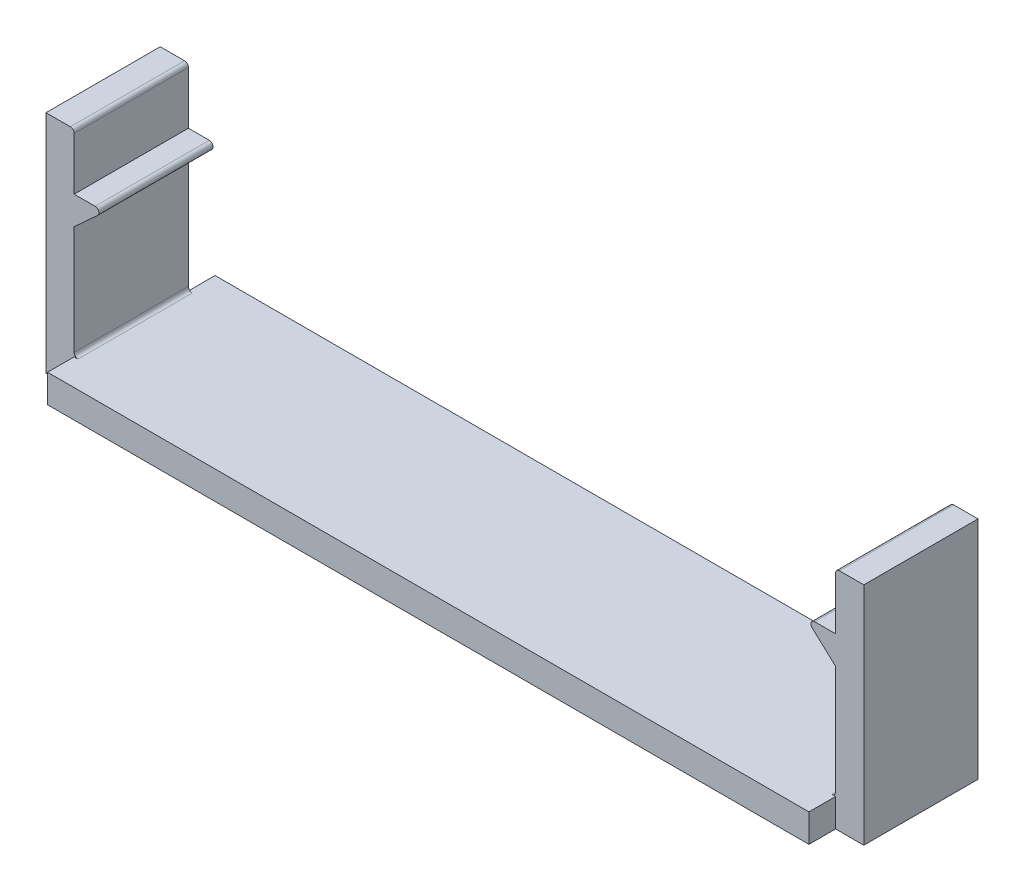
ISO-10303-21;
HEADER;
FILE_DESCRIPTION(('STEP AP214'),'2;1');
FILE_NAME('part.step','',(''),(''),'','','');
FILE_SCHEMA(('AUTOMOTIVE_DESIGN { 1 0 10303 214 1 1 1 1 }'));
ENDSEC;
DATA;
#1=APPLICATION_CONTEXT('core data for automotive mechanical design processes');
#2=APPLICATION_PROTOCOL_DEFINITION('international standard','automotive_design',2000,#1);
#3=PRODUCT_CONTEXT('',#1,'mechanical');
#4=PRODUCT('Part','Part','',(#3));
#5=PRODUCT_RELATED_PRODUCT_CATEGORY('part','',(#4));
#6=PRODUCT_DEFINITION_FORMATION('','',#4);
#7=PRODUCT_DEFINITION_CONTEXT('part definition',#1,'design');
#8=PRODUCT_DEFINITION('design','',#6,#7);
#9=PRODUCT_DEFINITION_SHAPE('','',#8);
#10=(LENGTH_UNIT() NAMED_UNIT(*) SI_UNIT(.MILLI.,.METRE.));
#11=(NAMED_UNIT(*) PLANE_ANGLE_UNIT() SI_UNIT($,.RADIAN.));
#12=(NAMED_UNIT(*) SI_UNIT($,.STERADIAN.) SOLID_ANGLE_UNIT());
#13=UNCERTAINTY_MEASURE_WITH_UNIT(LENGTH_MEASURE(1.E-05),#10,'distance_accuracy_value','');
#14=(GEOMETRIC_REPRESENTATION_CONTEXT(3) GLOBAL_UNCERTAINTY_ASSIGNED_CONTEXT((#13)) GLOBAL_UNIT_ASSIGNED_CONTEXT((#10,
#11,#12)) REPRESENTATION_CONTEXT('',''));
#15=CARTESIAN_POINT('',(0.,0.,0.));
#16=DIRECTION('',(0.,0.,1.));
#17=DIRECTION('',(1.,0.,0.));
#18=AXIS2_PLACEMENT_3D('',#15,#16,#17);
#19=CARTESIAN_POINT('',(12.7,-0.9398,2.794));
#20=DIRECTION('',(-1.,0.,0.));
#21=DIRECTION('',(0.,0.,1.));
#22=AXIS2_PLACEMENT_3D('',#19,#20,#21);
#23=PLANE('',#22);
#24=DIRECTION('',(0.,-1.,0.));
#25=VECTOR('',#24,1.);
#26=CARTESIAN_POINT('',(12.7,0.,-1.905));
#27=LINE('',#26,#25);
#28=CARTESIAN_POINT('',(12.7,0.,-1.905));
#29=VERTEX_POINT('',#28);
#30=CARTESIAN_POINT('',(12.7,-0.9398,-1.905));
#31=VERTEX_POINT('',#30);
#32=EDGE_CURVE('E469',#29,#31,#27,.T.);
#33=ORIENTED_EDGE('',*,*,#32,.T.);
#34=DIRECTION('',(0.,0.,-1.));
#35=VECTOR('',#34,1.);
#36=CARTESIAN_POINT('',(12.7,-0.9398,2.794));
#37=LINE('',#36,#35);
#38=CARTESIAN_POINT('',(12.7,-0.9398,-2.794));
#39=VERTEX_POINT('',#38);
#40=EDGE_CURVE('E244',#31,#39,#37,.T.);
#41=ORIENTED_EDGE('',*,*,#40,.T.);
#42=DIRECTION('',(0.,1.,0.));
#43=VECTOR('',#42,1.);
#44=CARTESIAN_POINT('',(12.7,-0.9398,-2.794));
#45=LINE('',#44,#43);
#46=CARTESIAN_POINT('',(12.7,0.,-2.794));
#47=VERTEX_POINT('',#46);
#48=EDGE_CURVE('E427',#39,#47,#45,.T.);
#49=ORIENTED_EDGE('',*,*,#48,.T.);
#50=DIRECTION('',(0.,0.,-1.));
#51=VECTOR('',#50,1.);
#52=CARTESIAN_POINT('',(12.7,0.,2.794));
#53=LINE('',#52,#51);
#54=EDGE_CURVE('E258',#29,#47,#53,.T.);
#55=ORIENTED_EDGE('',*,*,#54,.F.);
#56=EDGE_LOOP('',(#33,#41,#49,#55));
#57=FACE_BOUND('',#56,.T.);
#58=ADVANCED_FACE('F34',(#57),#23,.F.);
#59=CARTESIAN_POINT('',(-12.7,0.,1.905));
#60=DIRECTION('',(-1.,0.,0.));
#61=DIRECTION('',(0.,0.,1.));
#62=AXIS2_PLACEMENT_3D('',#59,#60,#61);
#63=PLANE('',#62);
#64=DIRECTION('',(0.,1.,0.));
#65=VECTOR('',#64,1.);
#66=CARTESIAN_POINT('',(-12.7,0.,1.905));
#67=LINE('',#66,#65);
#68=CARTESIAN_POINT('',(-12.7,0.126999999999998,1.905));
#69=VERTEX_POINT('',#68);
#70=CARTESIAN_POINT('',(-12.7,3.7592,1.905));
#71=VERTEX_POINT('',#70);
#72=EDGE_CURVE('E266',#69,#71,#67,.T.);
#73=ORIENTED_EDGE('',*,*,#72,.F.);
#74=DIRECTION('',(0.,0.,-1.));
#75=VECTOR('',#74,1.);
#76=CARTESIAN_POINT('',(-12.7,0.126999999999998,-1.905));
#77=LINE('',#76,#75);
#78=CARTESIAN_POINT('',(-12.7,0.126999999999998,-1.905));
#79=VERTEX_POINT('',#78);
#80=EDGE_CURVE('E359',#69,#79,#77,.T.);
#81=ORIENTED_EDGE('',*,*,#80,.T.);
#82=DIRECTION('',(0.,1.,0.));
#83=VECTOR('',#82,1.);
#84=CARTESIAN_POINT('',(-12.7,0.,-1.905));
#85=LINE('',#84,#83);
#86=CARTESIAN_POINT('',(-12.7,3.7592,-1.905));
#87=VERTEX_POINT('',#86);
#88=EDGE_CURVE('E261',#79,#87,#85,.T.);
#89=ORIENTED_EDGE('',*,*,#88,.T.);
#90=DIRECTION('',(0.,0.,-1.));
#91=VECTOR('',#90,1.);
#92=CARTESIAN_POINT('',(-12.7,3.7592,1.905));
#93=LINE('',#92,#91);
#94=EDGE_CURVE('E306',#71,#87,#93,.T.);
#95=ORIENTED_EDGE('',*,*,#94,.F.);
#96=EDGE_LOOP('',(#73,#81,#89,#95));
#97=FACE_BOUND('',#96,.T.);
#98=ADVANCED_FACE('F381',(#97),#63,.F.);
#99=CARTESIAN_POINT('',(-12.7,3.7592,1.905));
#100=DIRECTION('',(-0.676508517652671,0.736434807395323,0.));
#101=DIRECTION('',(-0.736434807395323,-0.676508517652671,0.));
#102=AXIS2_PLACEMENT_3D('',#99,#100,#101);
#103=PLANE('',#102);
#104=DIRECTION('',(0.736434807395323,0.676508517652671,0.));
#105=VECTOR('',#104,1.);
#106=CARTESIAN_POINT('',(-12.7,3.7592,-1.905));
#107=LINE('',#106,#105);
#108=CARTESIAN_POINT('',(-11.9170127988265,4.47847277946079,-1.905));
#109=VERTEX_POINT('',#108);
#110=EDGE_CURVE('E284',#87,#109,#107,.T.);
#111=ORIENTED_EDGE('',*,*,#110,.T.);
#112=DIRECTION('',(0.,0.,-1.));
#113=VECTOR('',#112,1.);
#114=CARTESIAN_POINT('',(-11.9170127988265,4.47847277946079,1.905));
#115=LINE('',#114,#113);
#116=CARTESIAN_POINT('',(-11.9170127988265,4.47847277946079,1.905));
#117=VERTEX_POINT('',#116);
#118=EDGE_CURVE('E343',#109,#117,#115,.F.);
#119=ORIENTED_EDGE('',*,*,#118,.T.);
#120=DIRECTION('',(0.736434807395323,0.676508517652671,0.));
#121=VECTOR('',#120,1.);
#122=CARTESIAN_POINT('',(-12.7,3.7592,1.905));
#123=LINE('',#122,#121);
#124=EDGE_CURVE('E265',#71,#117,#123,.T.);
#125=ORIENTED_EDGE('',*,*,#124,.F.);
#126=ORIENTED_EDGE('',*,*,#94,.T.);
#127=EDGE_LOOP('',(#111,#119,#125,#126));
#128=FACE_BOUND('',#127,.T.);
#129=ADVANCED_FACE('F384',(#128),#103,.F.);
#130=CARTESIAN_POINT('',(-12.7,4.699,1.905));
#131=DIRECTION('',(0.,-1.,0.));
#132=DIRECTION('',(0.,0.,-1.));
#133=AXIS2_PLACEMENT_3D('',#130,#131,#132);
#134=PLANE('',#133);
#135=DIRECTION('',(-1.,0.,0.));
#136=VECTOR('',#135,1.);
#137=CARTESIAN_POINT('',(-12.7,4.699,1.905));
#138=LINE('',#137,#136);
#139=CARTESIAN_POINT('',(-12.0029293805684,4.699,1.905));
#140=VERTEX_POINT('',#139);
#141=CARTESIAN_POINT('',(-12.7,4.699,1.905));
#142=VERTEX_POINT('',#141);
#143=EDGE_CURVE('E269',#140,#142,#138,.T.);
#144=ORIENTED_EDGE('',*,*,#143,.F.);
#145=DIRECTION('',(0.,0.,-1.));
#146=VECTOR('',#145,1.);
#147=CARTESIAN_POINT('',(-12.0029293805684,4.699,1.905));
#148=LINE('',#147,#146);
#149=CARTESIAN_POINT('',(-12.0029293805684,4.699,-1.905));
#150=VERTEX_POINT('',#149);
#151=EDGE_CURVE('E340',#140,#150,#148,.T.);
#152=ORIENTED_EDGE('',*,*,#151,.T.);
#153=DIRECTION('',(-1.,0.,0.));
#154=VECTOR('',#153,1.);
#155=CARTESIAN_POINT('',(-12.7,4.699,-1.905));
#156=LINE('',#155,#154);
#157=CARTESIAN_POINT('',(-12.7,4.699,-1.905));
#158=VERTEX_POINT('',#157);
#159=EDGE_CURVE('E287',#150,#158,#156,.T.);
#160=ORIENTED_EDGE('',*,*,#159,.T.);
#161=DIRECTION('',(0.,0.,-1.));
#162=VECTOR('',#161,1.);
#163=CARTESIAN_POINT('',(-12.7,4.699,1.905));
#164=LINE('',#163,#162);
#165=EDGE_CURVE('E303',#142,#158,#164,.T.);
#166=ORIENTED_EDGE('',*,*,#165,.F.);
#167=EDGE_LOOP('',(#144,#152,#160,#166));
#168=FACE_BOUND('',#167,.T.);
#169=ADVANCED_FACE('F393',(#168),#134,.F.);
#170=CARTESIAN_POINT('',(-12.7,4.699,1.905));
#171=DIRECTION('',(-1.,0.,0.));
#172=DIRECTION('',(0.,0.,1.));
#173=AXIS2_PLACEMENT_3D('',#170,#171,#172);
#174=PLANE('',#173);
#175=DIRECTION('',(0.,1.,0.));
#176=VECTOR('',#175,1.);
#177=CARTESIAN_POINT('',(-12.7,4.699,-1.905));
#178=LINE('',#177,#176);
#179=CARTESIAN_POINT('',(-12.7,6.45668,-1.905));
#180=VERTEX_POINT('',#179);
#181=EDGE_CURVE('E289',#158,#180,#178,.T.);
#182=ORIENTED_EDGE('',*,*,#181,.T.);
#183=DIRECTION('',(0.,0.,-1.));
#184=VECTOR('',#183,1.);
#185=CARTESIAN_POINT('',(-12.7,6.45668,1.905));
#186=LINE('',#185,#184);
#187=CARTESIAN_POINT('',(-12.7,6.45668,1.905));
#188=VERTEX_POINT('',#187);
#189=EDGE_CURVE('E329',#180,#188,#186,.F.);
#190=ORIENTED_EDGE('',*,*,#189,.T.);
#191=DIRECTION('',(0.,1.,0.));
#192=VECTOR('',#191,1.);
#193=CARTESIAN_POINT('',(-12.7,4.699,1.905));
#194=LINE('',#193,#192);
#195=EDGE_CURVE('E271',#142,#188,#194,.T.);
#196=ORIENTED_EDGE('',*,*,#195,.F.);
#197=ORIENTED_EDGE('',*,*,#165,.T.);
#198=EDGE_LOOP('',(#182,#190,#196,#197));
#199=FACE_BOUND('',#198,.T.);
#200=ADVANCED_FACE('F398',(#199),#174,.F.);
#201=CARTESIAN_POINT('',(-12.7,6.58368,1.905));
#202=DIRECTION('',(0.,-1.,0.));
#203=DIRECTION('',(0.,0.,-1.));
#204=AXIS2_PLACEMENT_3D('',#201,#202,#203);
#205=PLANE('',#204);
#206=DIRECTION('',(-1.,0.,0.));
#207=VECTOR('',#206,1.);
#208=CARTESIAN_POINT('',(-12.7,6.58368,1.905));
#209=LINE('',#208,#207);
#210=CARTESIAN_POINT('',(-12.827,6.58368,1.905));
#211=VERTEX_POINT('',#210);
#212=CARTESIAN_POINT('',(-13.6398,6.58368,1.905));
#213=VERTEX_POINT('',#212);
#214=EDGE_CURVE('E274',#211,#213,#209,.T.);
#215=ORIENTED_EDGE('',*,*,#214,.F.);
#216=DIRECTION('',(0.,0.,-1.));
#217=VECTOR('',#216,1.);
#218=CARTESIAN_POINT('',(-12.827,6.58368,1.905));
#219=LINE('',#218,#217);
#220=CARTESIAN_POINT('',(-12.827,6.58368,-1.905));
#221=VERTEX_POINT('',#220);
#222=EDGE_CURVE('E322',#211,#221,#219,.T.);
#223=ORIENTED_EDGE('',*,*,#222,.T.);
#224=DIRECTION('',(-1.,0.,0.));
#225=VECTOR('',#224,1.);
#226=CARTESIAN_POINT('',(-12.7,6.58368,-1.905));
#227=LINE('',#226,#225);
#228=CARTESIAN_POINT('',(-13.6398,6.58368,-1.905));
#229=VERTEX_POINT('',#228);
#230=EDGE_CURVE('E292',#221,#229,#227,.T.);
#231=ORIENTED_EDGE('',*,*,#230,.T.);
#232=DIRECTION('',(0.,0.,-1.));
#233=VECTOR('',#232,1.);
#234=CARTESIAN_POINT('',(-13.6398,6.58368,1.905));
#235=LINE('',#234,#233);
#236=EDGE_CURVE('E300',#213,#229,#235,.T.);
#237=ORIENTED_EDGE('',*,*,#236,.F.);
#238=EDGE_LOOP('',(#215,#223,#231,#237));
#239=FACE_BOUND('',#238,.T.);
#240=ADVANCED_FACE('F407',(#239),#205,.F.);
#241=CARTESIAN_POINT('',(-13.6398,6.58368,1.905));
#242=DIRECTION('',(1.,0.,0.));
#243=DIRECTION('',(0.,0.,-1.));
#244=AXIS2_PLACEMENT_3D('',#241,#242,#243);
#245=PLANE('',#244);
#246=DIRECTION('',(0.,-1.,0.));
#247=VECTOR('',#246,1.);
#248=CARTESIAN_POINT('',(-13.6398,6.58368,-1.905));
#249=LINE('',#248,#247);
#250=CARTESIAN_POINT('',(-13.6398,-0.9398,-1.905));
#251=VERTEX_POINT('',#250);
#252=EDGE_CURVE('E294',#229,#251,#249,.T.);
#253=ORIENTED_EDGE('',*,*,#252,.T.);
#254=DIRECTION('',(0.,0.,-1.));
#255=VECTOR('',#254,1.);
#256=CARTESIAN_POINT('',(-13.6398,-0.9398,1.905));
#257=LINE('',#256,#255);
#258=CARTESIAN_POINT('',(-13.6398,-0.9398,1.905));
#259=VERTEX_POINT('',#258);
#260=EDGE_CURVE('E280',#259,#251,#257,.T.);
#261=ORIENTED_EDGE('',*,*,#260,.F.);
#262=DIRECTION('',(0.,-1.,0.));
#263=VECTOR('',#262,1.);
#264=CARTESIAN_POINT('',(-13.6398,6.58368,1.905));
#265=LINE('',#264,#263);
#266=EDGE_CURVE('E276',#213,#259,#265,.T.);
#267=ORIENTED_EDGE('',*,*,#266,.F.);
#268=ORIENTED_EDGE('',*,*,#236,.T.);
#269=EDGE_LOOP('',(#253,#261,#267,#268));
#270=FACE_BOUND('',#269,.T.);
#271=ADVANCED_FACE('F412',(#270),#245,.F.);
#272=CARTESIAN_POINT('',(-13.6398,-0.9398,1.905));
#273=DIRECTION('',(0.,1.,0.));
#274=DIRECTION('',(-1.,0.,0.));
#275=AXIS2_PLACEMENT_3D('',#272,#273,#274);
#276=PLANE('',#275);
#277=DIRECTION('',(1.,0.,0.));
#278=VECTOR('',#277,1.);
#279=CARTESIAN_POINT('',(-13.6398,-0.9398,-1.905));
#280=LINE('',#279,#278);
#281=CARTESIAN_POINT('',(-12.7,-0.9398,-1.905));
#282=VERTEX_POINT('',#281);
#283=EDGE_CURVE('E296',#251,#282,#280,.T.);
#284=ORIENTED_EDGE('',*,*,#283,.T.);
#285=DIRECTION('',(0.,0.,-1.));
#286=VECTOR('',#285,1.);
#287=CARTESIAN_POINT('',(-12.7,-0.9398,2.794));
#288=LINE('',#287,#286);
#289=CARTESIAN_POINT('',(-12.7,-0.9398,-2.794));
#290=VERTEX_POINT('',#289);
#291=EDGE_CURVE('E243',#282,#290,#288,.T.);
#292=ORIENTED_EDGE('',*,*,#291,.T.);
#293=DIRECTION('',(1.,0.,0.));
#294=VECTOR('',#293,1.);
#295=CARTESIAN_POINT('',(-12.7,-0.9398,-2.794));
#296=LINE('',#295,#294);
#297=EDGE_CURVE('E250',#290,#39,#296,.T.);
#298=ORIENTED_EDGE('',*,*,#297,.T.);
#299=ORIENTED_EDGE('',*,*,#40,.F.);
#300=DIRECTION('',(1.,0.,0.));
#301=VECTOR('',#300,1.);
#302=CARTESIAN_POINT('',(13.6398,-0.9398,-1.905));
#303=LINE('',#302,#301);
#304=CARTESIAN_POINT('',(13.6398,-0.9398,-1.905));
#305=VERTEX_POINT('',#304);
#306=EDGE_CURVE('E464',#31,#305,#303,.T.);
#307=ORIENTED_EDGE('',*,*,#306,.T.);
#308=DIRECTION('',(0.,0.,-1.));
#309=VECTOR('',#308,1.);
#310=CARTESIAN_POINT('',(13.6398,-0.9398,1.905));
#311=LINE('',#310,#309);
#312=CARTESIAN_POINT('',(13.6398,-0.9398,1.905));
#313=VERTEX_POINT('',#312);
#314=EDGE_CURVE('E236',#313,#305,#311,.T.);
#315=ORIENTED_EDGE('',*,*,#314,.F.);
#316=DIRECTION('',(1.,0.,0.));
#317=VECTOR('',#316,1.);
#318=CARTESIAN_POINT('',(13.6398,-0.9398,1.905));
#319=LINE('',#318,#317);
#320=CARTESIAN_POINT('',(12.7,-0.9398,1.905));
#321=VERTEX_POINT('',#320);
#322=EDGE_CURVE('E220',#321,#313,#319,.T.);
#323=ORIENTED_EDGE('',*,*,#322,.F.);
#324=CARTESIAN_POINT('',(12.7,-0.9398,2.794));
#325=VERTEX_POINT('',#324);
#326=EDGE_CURVE('E233',#325,#321,#37,.T.);
#327=ORIENTED_EDGE('',*,*,#326,.F.);
#328=DIRECTION('',(1.,0.,0.));
#329=VECTOR('',#328,1.);
#330=CARTESIAN_POINT('',(-12.7,-0.9398,2.794));
#331=LINE('',#330,#329);
#332=CARTESIAN_POINT('',(-12.7,-0.9398,2.794));
#333=VERTEX_POINT('',#332);
#334=EDGE_CURVE('E248',#333,#325,#331,.T.);
#335=ORIENTED_EDGE('',*,*,#334,.F.);
#336=CARTESIAN_POINT('',(-12.7,-0.9398,1.905));
#337=VERTEX_POINT('',#336);
#338=EDGE_CURVE('E246',#333,#337,#288,.T.);
#339=ORIENTED_EDGE('',*,*,#338,.T.);
#340=DIRECTION('',(1.,0.,0.));
#341=VECTOR('',#340,1.);
#342=CARTESIAN_POINT('',(-13.6398,-0.9398,1.905));
#343=LINE('',#342,#341);
#344=EDGE_CURVE('E278',#259,#337,#343,.T.);
#345=ORIENTED_EDGE('',*,*,#344,.F.);
#346=ORIENTED_EDGE('',*,*,#260,.T.);
#347=EDGE_LOOP('',(#284,#292,#298,#299,#307,#315,#323,#327,#335,#339,#345,#346));
#348=FACE_BOUND('',#347,.T.);
#349=ADVANCED_FACE('F231',(#348),#276,.F.);
#350=CARTESIAN_POINT('',(-12.7,6.58368,1.905));
#351=DIRECTION('',(0.,0.,-1.));
#352=DIRECTION('',(-1.,0.,0.));
#353=AXIS2_PLACEMENT_3D('',#350,#351,#352);
#354=PLANE('',#353);
#355=ORIENTED_EDGE('',*,*,#195,.T.);
#356=CARTESIAN_POINT('',(-12.827,6.45668,1.905));
#357=DIRECTION('',(0.,0.,-1.));
#358=DIRECTION('',(-1.,0.,0.));
#359=AXIS2_PLACEMENT_3D('',#356,#357,#358);
#360=CIRCLE('',#359,0.127);
#361=EDGE_CURVE('E333',#188,#211,#360,.F.);
#362=ORIENTED_EDGE('',*,*,#361,.T.);
#363=ORIENTED_EDGE('',*,*,#214,.T.);
#364=ORIENTED_EDGE('',*,*,#266,.T.);
#365=ORIENTED_EDGE('',*,*,#344,.T.);
#366=CARTESIAN_POINT('',(-12.7,0.,1.905));
#367=VERTEX_POINT('',#366);
#368=EDGE_CURVE('E262',#337,#367,#67,.T.);
#369=ORIENTED_EDGE('',*,*,#368,.T.);
#370=DIRECTION('',(-1.,0.,0.));
#371=VECTOR('',#370,1.);
#372=CARTESIAN_POINT('',(-12.7,0.,1.905));
#373=LINE('',#372,#371);
#374=CARTESIAN_POINT('',(-12.573,0.,1.905));
#375=VERTEX_POINT('',#374);
#376=EDGE_CURVE('E345',#375,#367,#373,.T.);
#377=ORIENTED_EDGE('',*,*,#376,.F.);
#378=CARTESIAN_POINT('',(-12.573,0.126999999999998,1.905));
#379=DIRECTION('',(0.,0.,-1.));
#380=DIRECTION('',(-1.,0.,0.));
#381=AXIS2_PLACEMENT_3D('',#378,#379,#380);
#382=CIRCLE('',#381,0.127);
#383=EDGE_CURVE('E11',#375,#69,#382,.T.);
#384=ORIENTED_EDGE('',*,*,#383,.T.);
#385=ORIENTED_EDGE('',*,*,#72,.T.);
#386=ORIENTED_EDGE('',*,*,#124,.T.);
#387=CARTESIAN_POINT('',(-12.0029293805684,4.572,1.905));
#388=DIRECTION('',(0.,0.,-1.));
#389=DIRECTION('',(-1.,0.,0.));
#390=AXIS2_PLACEMENT_3D('',#387,#388,#389);
#391=CIRCLE('',#390,0.127);
#392=EDGE_CURVE('E331',#117,#140,#391,.F.);
#393=ORIENTED_EDGE('',*,*,#392,.T.);
#394=ORIENTED_EDGE('',*,*,#143,.T.);
#395=EDGE_LOOP('',(#355,#362,#363,#364,#365,#369,#377,#384,#385,#386,#393,#394));
#396=FACE_BOUND('',#395,.T.);
#397=ADVANCED_FACE('F378',(#396),#354,.F.);
#398=CARTESIAN_POINT('',(-12.7,6.58368,-1.905));
#399=DIRECTION('',(0.,0.,-1.));
#400=DIRECTION('',(-1.,0.,0.));
#401=AXIS2_PLACEMENT_3D('',#398,#399,#400);
#402=PLANE('',#401);
#403=ORIENTED_EDGE('',*,*,#230,.F.);
#404=CARTESIAN_POINT('',(-12.827,6.45668,-1.905));
#405=DIRECTION('',(0.,0.,-1.));
#406=DIRECTION('',(-1.,0.,0.));
#407=AXIS2_PLACEMENT_3D('',#404,#405,#406);
#408=CIRCLE('',#407,0.127);
#409=EDGE_CURVE('E327',#221,#180,#408,.T.);
#410=ORIENTED_EDGE('',*,*,#409,.T.);
#411=ORIENTED_EDGE('',*,*,#181,.F.);
#412=ORIENTED_EDGE('',*,*,#159,.F.);
#413=CARTESIAN_POINT('',(-12.0029293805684,4.572,-1.905));
#414=DIRECTION('',(0.,0.,-1.));
#415=DIRECTION('',(-1.,0.,0.));
#416=AXIS2_PLACEMENT_3D('',#413,#414,#415);
#417=CIRCLE('',#416,0.127);
#418=EDGE_CURVE('E325',#150,#109,#417,.T.);
#419=ORIENTED_EDGE('',*,*,#418,.T.);
#420=ORIENTED_EDGE('',*,*,#110,.F.);
#421=ORIENTED_EDGE('',*,*,#88,.F.);
#422=CARTESIAN_POINT('',(-12.573,0.126999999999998,-1.905));
#423=DIRECTION('',(0.,0.,-1.));
#424=DIRECTION('',(-1.,0.,0.));
#425=AXIS2_PLACEMENT_3D('',#422,#423,#424);
#426=CIRCLE('',#425,0.127);
#427=CARTESIAN_POINT('',(-12.573,0.,-1.905));
#428=VERTEX_POINT('',#427);
#429=EDGE_CURVE('E42',#79,#428,#426,.F.);
#430=ORIENTED_EDGE('',*,*,#429,.T.);
#431=DIRECTION('',(1.,0.,0.));
#432=VECTOR('',#431,1.);
#433=CARTESIAN_POINT('',(12.7,0.,-1.905));
#434=LINE('',#433,#432);
#435=CARTESIAN_POINT('',(-12.7,0.,-1.905));
#436=VERTEX_POINT('',#435);
#437=EDGE_CURVE('E49',#436,#428,#434,.T.);
#438=ORIENTED_EDGE('',*,*,#437,.F.);
#439=EDGE_CURVE('E281',#282,#436,#85,.T.);
#440=ORIENTED_EDGE('',*,*,#439,.F.);
#441=ORIENTED_EDGE('',*,*,#283,.F.);
#442=ORIENTED_EDGE('',*,*,#252,.F.);
#443=EDGE_LOOP('',(#403,#410,#411,#412,#419,#420,#421,#430,#438,#440,#441,#442));
#444=FACE_BOUND('',#443,.T.);
#445=ADVANCED_FACE('F367',(#444),#402,.T.);
#446=CARTESIAN_POINT('',(-12.7,0.,2.794));
#447=DIRECTION('',(1.,0.,0.));
#448=DIRECTION('',(0.,0.,-1.));
#449=AXIS2_PLACEMENT_3D('',#446,#447,#448);
#450=PLANE('',#449);
#451=DIRECTION('',(0.,0.,-1.));
#452=VECTOR('',#451,1.);
#453=CARTESIAN_POINT('',(-12.7,0.,2.794));
#454=LINE('',#453,#452);
#455=CARTESIAN_POINT('',(-12.7,0.,2.794));
#456=VERTEX_POINT('',#455);
#457=EDGE_CURVE('E255',#456,#367,#454,.T.);
#458=ORIENTED_EDGE('',*,*,#457,.T.);
#459=ORIENTED_EDGE('',*,*,#368,.F.);
#460=ORIENTED_EDGE('',*,*,#338,.F.);
#461=DIRECTION('',(0.,-1.,0.));
#462=VECTOR('',#461,1.);
#463=CARTESIAN_POINT('',(-12.7,0.,2.794));
#464=LINE('',#463,#462);
#465=EDGE_CURVE('E421',#456,#333,#464,.T.);
#466=ORIENTED_EDGE('',*,*,#465,.F.);
#467=EDGE_LOOP('',(#458,#459,#460,#466));
#468=FACE_BOUND('',#467,.T.);
#469=ADVANCED_FACE('F417',(#468),#450,.F.);
#470=ORIENTED_EDGE('',*,*,#326,.T.);
#471=DIRECTION('',(0.,-1.,0.));
#472=VECTOR('',#471,1.);
#473=CARTESIAN_POINT('',(12.7,0.,1.905));
#474=LINE('',#473,#472);
#475=CARTESIAN_POINT('',(12.7,0.,1.905));
#476=VERTEX_POINT('',#475);
#477=EDGE_CURVE('E216',#476,#321,#474,.T.);
#478=ORIENTED_EDGE('',*,*,#477,.F.);
#479=CARTESIAN_POINT('',(12.7,0.,2.794));
#480=VERTEX_POINT('',#479);
#481=EDGE_CURVE('E259',#480,#476,#53,.T.);
#482=ORIENTED_EDGE('',*,*,#481,.F.);
#483=DIRECTION('',(0.,1.,0.));
#484=VECTOR('',#483,1.);
#485=CARTESIAN_POINT('',(12.7,-0.9398,2.794));
#486=LINE('',#485,#484);
#487=EDGE_CURVE('E242',#325,#480,#486,.T.);
#488=ORIENTED_EDGE('',*,*,#487,.F.);
#489=EDGE_LOOP('',(#470,#478,#482,#488));
#490=FACE_BOUND('',#489,.T.);
#491=ADVANCED_FACE('F240',(#490),#23,.F.);
#492=CARTESIAN_POINT('',(12.7,0.,2.794));
#493=DIRECTION('',(0.,-1.,0.));
#494=DIRECTION('',(1.,0.,0.));
#495=AXIS2_PLACEMENT_3D('',#492,#493,#494);
#496=PLANE('',#495);
#497=DIRECTION('',(0.,0.,-1.));
#498=VECTOR('',#497,1.);
#499=CARTESIAN_POINT('',(12.573,0.,-1.905));
#500=LINE('',#499,#498);
#501=CARTESIAN_POINT('',(12.573,0.,1.905));
#502=VERTEX_POINT('',#501);
#503=CARTESIAN_POINT('',(12.573,0.,-1.905));
#504=VERTEX_POINT('',#503);
#505=EDGE_CURVE('E352',#502,#504,#500,.T.);
#506=ORIENTED_EDGE('',*,*,#505,.T.);
#507=DIRECTION('',(1.,0.,0.));
#508=VECTOR('',#507,1.);
#509=CARTESIAN_POINT('',(12.7,0.,-1.905));
#510=LINE('',#509,#508);
#511=EDGE_CURVE('E355',#504,#29,#510,.T.);
#512=ORIENTED_EDGE('',*,*,#511,.T.);
#513=ORIENTED_EDGE('',*,*,#54,.T.);
#514=DIRECTION('',(-1.,0.,0.));
#515=VECTOR('',#514,1.);
#516=CARTESIAN_POINT('',(12.7,0.,-2.794));
#517=LINE('',#516,#515);
#518=CARTESIAN_POINT('',(-12.7,0.,-2.794));
#519=VERTEX_POINT('',#518);
#520=EDGE_CURVE('E430',#47,#519,#517,.T.);
#521=ORIENTED_EDGE('',*,*,#520,.T.);
#522=EDGE_CURVE('E254',#436,#519,#454,.T.);
#523=ORIENTED_EDGE('',*,*,#522,.F.);
#524=ORIENTED_EDGE('',*,*,#437,.T.);
#525=DIRECTION('',(0.,0.,-1.));
#526=VECTOR('',#525,1.);
#527=CARTESIAN_POINT('',(-12.573,0.,1.905));
#528=LINE('',#527,#526);
#529=EDGE_CURVE('E347',#428,#375,#528,.F.);
#530=ORIENTED_EDGE('',*,*,#529,.T.);
#531=ORIENTED_EDGE('',*,*,#376,.T.);
#532=ORIENTED_EDGE('',*,*,#457,.F.);
#533=DIRECTION('',(-1.,0.,0.));
#534=VECTOR('',#533,1.);
#535=CARTESIAN_POINT('',(12.7,0.,2.794));
#536=LINE('',#535,#534);
#537=EDGE_CURVE('E423',#480,#456,#536,.T.);
#538=ORIENTED_EDGE('',*,*,#537,.F.);
#539=ORIENTED_EDGE('',*,*,#481,.T.);
#540=DIRECTION('',(-1.,0.,0.));
#541=VECTOR('',#540,1.);
#542=CARTESIAN_POINT('',(12.7,0.,1.905));
#543=LINE('',#542,#541);
#544=EDGE_CURVE('E57',#476,#502,#543,.T.);
#545=ORIENTED_EDGE('',*,*,#544,.T.);
#546=EDGE_LOOP('',(#506,#512,#513,#521,#523,#524,#530,#531,#532,#538,#539,#545));
#547=FACE_BOUND('',#546,.T.);
#548=ADVANCED_FACE('F373',(#547),#496,.F.);
#549=ORIENTED_EDGE('',*,*,#439,.T.);
#550=ORIENTED_EDGE('',*,*,#522,.T.);
#551=DIRECTION('',(0.,-1.,0.));
#552=VECTOR('',#551,1.);
#553=CARTESIAN_POINT('',(-12.7,0.,-2.794));
#554=LINE('',#553,#552);
#555=EDGE_CURVE('E431',#519,#290,#554,.T.);
#556=ORIENTED_EDGE('',*,*,#555,.T.);
#557=ORIENTED_EDGE('',*,*,#291,.F.);
#558=EDGE_LOOP('',(#549,#550,#556,#557));
#559=FACE_BOUND('',#558,.T.);
#560=ADVANCED_FACE('F493',(#559),#450,.F.);
#561=CARTESIAN_POINT('',(12.7,-0.9398,2.794));
#562=DIRECTION('',(0.,0.,-1.));
#563=DIRECTION('',(-1.,0.,0.));
#564=AXIS2_PLACEMENT_3D('',#561,#562,#563);
#565=PLANE('',#564);
#566=ORIENTED_EDGE('',*,*,#487,.T.);
#567=ORIENTED_EDGE('',*,*,#537,.T.);
#568=ORIENTED_EDGE('',*,*,#465,.T.);
#569=ORIENTED_EDGE('',*,*,#334,.T.);
#570=EDGE_LOOP('',(#566,#567,#568,#569));
#571=FACE_BOUND('',#570,.T.);
#572=ADVANCED_FACE('F490',(#571),#565,.F.);
#573=CARTESIAN_POINT('',(12.7,-0.9398,-2.794));
#574=DIRECTION('',(0.,0.,-1.));
#575=DIRECTION('',(-1.,0.,0.));
#576=AXIS2_PLACEMENT_3D('',#573,#574,#575);
#577=PLANE('',#576);
#578=ORIENTED_EDGE('',*,*,#48,.F.);
#579=ORIENTED_EDGE('',*,*,#297,.F.);
#580=ORIENTED_EDGE('',*,*,#555,.F.);
#581=ORIENTED_EDGE('',*,*,#520,.F.);
#582=EDGE_LOOP('',(#578,#579,#580,#581));
#583=FACE_BOUND('',#582,.T.);
#584=ADVANCED_FACE('F492',(#583),#577,.T.);
#585=CARTESIAN_POINT('',(12.7,0.,1.905));
#586=DIRECTION('',(1.,0.,0.));
#587=DIRECTION('',(0.,0.,-1.));
#588=AXIS2_PLACEMENT_3D('',#585,#586,#587);
#589=PLANE('',#588);
#590=CARTESIAN_POINT('',(12.7,3.7592,-1.905));
#591=VERTEX_POINT('',#590);
#592=CARTESIAN_POINT('',(12.7,0.127000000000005,-1.905));
#593=VERTEX_POINT('',#592);
#594=EDGE_CURVE('E466',#591,#593,#27,.T.);
#595=ORIENTED_EDGE('',*,*,#594,.T.);
#596=DIRECTION('',(0.,0.,-1.));
#597=VECTOR('',#596,1.);
#598=CARTESIAN_POINT('',(12.7,0.127000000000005,1.905));
#599=LINE('',#598,#597);
#600=CARTESIAN_POINT('',(12.7,0.127000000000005,1.905));
#601=VERTEX_POINT('',#600);
#602=EDGE_CURVE('E357',#593,#601,#599,.F.);
#603=ORIENTED_EDGE('',*,*,#602,.T.);
#604=CARTESIAN_POINT('',(12.7,3.7592,1.905));
#605=VERTEX_POINT('',#604);
#606=EDGE_CURVE('E225',#605,#601,#474,.T.);
#607=ORIENTED_EDGE('',*,*,#606,.F.);
#608=DIRECTION('',(0.,0.,-1.));
#609=VECTOR('',#608,1.);
#610=CARTESIAN_POINT('',(12.7,3.7592,1.905));
#611=LINE('',#610,#609);
#612=EDGE_CURVE('E449',#605,#591,#611,.T.);
#613=ORIENTED_EDGE('',*,*,#612,.T.);
#614=EDGE_LOOP('',(#595,#603,#607,#613));
#615=FACE_BOUND('',#614,.T.);
#616=ADVANCED_FACE('F499',(#615),#589,.F.);
#617=CARTESIAN_POINT('',(13.6398,6.58368,1.905));
#618=DIRECTION('',(-1.,0.,0.));
#619=DIRECTION('',(0.,0.,1.));
#620=AXIS2_PLACEMENT_3D('',#617,#618,#619);
#621=PLANE('',#620);
#622=DIRECTION('',(0.,1.,0.));
#623=VECTOR('',#622,1.);
#624=CARTESIAN_POINT('',(13.6398,6.58368,-1.905));
#625=LINE('',#624,#623);
#626=CARTESIAN_POINT('',(13.6398,6.58368,-1.905));
#627=VERTEX_POINT('',#626);
#628=EDGE_CURVE('E462',#305,#627,#625,.T.);
#629=ORIENTED_EDGE('',*,*,#628,.T.);
#630=DIRECTION('',(0.,0.,-1.));
#631=VECTOR('',#630,1.);
#632=CARTESIAN_POINT('',(13.6398,6.58368,1.905));
#633=LINE('',#632,#631);
#634=CARTESIAN_POINT('',(13.6398,6.58368,1.905));
#635=VERTEX_POINT('',#634);
#636=EDGE_CURVE('E443',#635,#627,#633,.T.);
#637=ORIENTED_EDGE('',*,*,#636,.F.);
#638=DIRECTION('',(0.,1.,0.));
#639=VECTOR('',#638,1.);
#640=CARTESIAN_POINT('',(13.6398,6.58368,1.905));
#641=LINE('',#640,#639);
#642=EDGE_CURVE('E238',#313,#635,#641,.T.);
#643=ORIENTED_EDGE('',*,*,#642,.F.);
#644=ORIENTED_EDGE('',*,*,#314,.T.);
#645=EDGE_LOOP('',(#629,#637,#643,#644));
#646=FACE_BOUND('',#645,.T.);
#647=ADVANCED_FACE('F644',(#646),#621,.F.);
#648=CARTESIAN_POINT('',(12.7,6.58368,1.905));
#649=DIRECTION('',(0.,-1.,0.));
#650=DIRECTION('',(0.,0.,-1.));
#651=AXIS2_PLACEMENT_3D('',#648,#649,#650);
#652=PLANE('',#651);
#653=DIRECTION('',(-1.,0.,0.));
#654=VECTOR('',#653,1.);
#655=CARTESIAN_POINT('',(12.7,6.58368,-1.905));
#656=LINE('',#655,#654);
#657=CARTESIAN_POINT('',(12.827,6.58368,-1.905));
#658=VERTEX_POINT('',#657);
#659=EDGE_CURVE('E459',#627,#658,#656,.T.);
#660=ORIENTED_EDGE('',*,*,#659,.T.);
#661=DIRECTION('',(0.,0.,-1.));
#662=VECTOR('',#661,1.);
#663=CARTESIAN_POINT('',(12.827,6.58368,1.905));
#664=LINE('',#663,#662);
#665=CARTESIAN_POINT('',(12.827,6.58368,1.905));
#666=VERTEX_POINT('',#665);
#667=EDGE_CURVE('E316',#658,#666,#664,.F.);
#668=ORIENTED_EDGE('',*,*,#667,.T.);
#669=DIRECTION('',(-1.,0.,0.));
#670=VECTOR('',#669,1.);
#671=CARTESIAN_POINT('',(12.7,6.58368,1.905));
#672=LINE('',#671,#670);
#673=EDGE_CURVE('E476',#635,#666,#672,.T.);
#674=ORIENTED_EDGE('',*,*,#673,.F.);
#675=ORIENTED_EDGE('',*,*,#636,.T.);
#676=EDGE_LOOP('',(#660,#668,#674,#675));
#677=FACE_BOUND('',#676,.T.);
#678=ADVANCED_FACE('F634',(#677),#652,.F.);
#679=CARTESIAN_POINT('',(12.7,4.699,1.905));
#680=DIRECTION('',(1.,0.,0.));
#681=DIRECTION('',(0.,0.,-1.));
#682=AXIS2_PLACEMENT_3D('',#679,#680,#681);
#683=PLANE('',#682);
#684=DIRECTION('',(0.,-1.,0.));
#685=VECTOR('',#684,1.);
#686=CARTESIAN_POINT('',(12.7,4.699,1.905));
#687=LINE('',#686,#685);
#688=CARTESIAN_POINT('',(12.7,6.45668,1.905));
#689=VERTEX_POINT('',#688);
#690=CARTESIAN_POINT('',(12.7,4.699,1.905));
#691=VERTEX_POINT('',#690);
#692=EDGE_CURVE('E474',#689,#691,#687,.T.);
#693=ORIENTED_EDGE('',*,*,#692,.F.);
#694=DIRECTION('',(0.,0.,-1.));
#695=VECTOR('',#694,1.);
#696=CARTESIAN_POINT('',(12.7,6.45668,1.905));
#697=LINE('',#696,#695);
#698=CARTESIAN_POINT('',(12.7,6.45668,-1.905));
#699=VERTEX_POINT('',#698);
#700=EDGE_CURVE('E309',#689,#699,#697,.T.);
#701=ORIENTED_EDGE('',*,*,#700,.T.);
#702=DIRECTION('',(0.,-1.,0.));
#703=VECTOR('',#702,1.);
#704=CARTESIAN_POINT('',(12.7,4.699,-1.905));
#705=LINE('',#704,#703);
#706=CARTESIAN_POINT('',(12.7,4.699,-1.905));
#707=VERTEX_POINT('',#706);
#708=EDGE_CURVE('E457',#699,#707,#705,.T.);
#709=ORIENTED_EDGE('',*,*,#708,.T.);
#710=DIRECTION('',(0.,0.,-1.));
#711=VECTOR('',#710,1.);
#712=CARTESIAN_POINT('',(12.7,4.699,1.905));
#713=LINE('',#712,#711);
#714=EDGE_CURVE('E446',#691,#707,#713,.T.);
#715=ORIENTED_EDGE('',*,*,#714,.F.);
#716=EDGE_LOOP('',(#693,#701,#709,#715));
#717=FACE_BOUND('',#716,.T.);
#718=ADVANCED_FACE('F624',(#717),#683,.F.);
#719=CARTESIAN_POINT('',(12.7,4.699,1.905));
#720=DIRECTION('',(0.,-1.,0.));
#721=DIRECTION('',(0.,0.,-1.));
#722=AXIS2_PLACEMENT_3D('',#719,#720,#721);
#723=PLANE('',#722);
#724=DIRECTION('',(-1.,0.,0.));
#725=VECTOR('',#724,1.);
#726=CARTESIAN_POINT('',(12.7,4.699,-1.905));
#727=LINE('',#726,#725);
#728=CARTESIAN_POINT('',(12.0029293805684,4.699,-1.905));
#729=VERTEX_POINT('',#728);
#730=EDGE_CURVE('E454',#707,#729,#727,.T.);
#731=ORIENTED_EDGE('',*,*,#730,.T.);
#732=DIRECTION('',(0.,0.,-1.));
#733=VECTOR('',#732,1.);
#734=CARTESIAN_POINT('',(12.0029293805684,4.699,1.905));
#735=LINE('',#734,#733);
#736=CARTESIAN_POINT('',(12.0029293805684,4.699,1.905));
#737=VERTEX_POINT('',#736);
#738=EDGE_CURVE('E338',#729,#737,#735,.F.);
#739=ORIENTED_EDGE('',*,*,#738,.T.);
#740=DIRECTION('',(-1.,0.,0.));
#741=VECTOR('',#740,1.);
#742=CARTESIAN_POINT('',(12.7,4.699,1.905));
#743=LINE('',#742,#741);
#744=EDGE_CURVE('E471',#691,#737,#743,.T.);
#745=ORIENTED_EDGE('',*,*,#744,.F.);
#746=ORIENTED_EDGE('',*,*,#714,.T.);
#747=EDGE_LOOP('',(#731,#739,#745,#746));
#748=FACE_BOUND('',#747,.T.);
#749=ADVANCED_FACE('F614',(#748),#723,.F.);
#750=CARTESIAN_POINT('',(12.7,3.7592,1.905));
#751=DIRECTION('',(0.676508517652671,0.736434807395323,0.));
#752=DIRECTION('',(-0.736434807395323,0.676508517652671,0.));
#753=AXIS2_PLACEMENT_3D('',#750,#751,#752);
#754=PLANE('',#753);
#755=DIRECTION('',(0.736434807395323,-0.676508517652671,0.));
#756=VECTOR('',#755,1.);
#757=CARTESIAN_POINT('',(12.7,3.7592,1.905));
#758=LINE('',#757,#756);
#759=CARTESIAN_POINT('',(11.9170127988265,4.47847277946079,1.905));
#760=VERTEX_POINT('',#759);
#761=EDGE_CURVE('E452',#760,#605,#758,.T.);
#762=ORIENTED_EDGE('',*,*,#761,.F.);
#763=DIRECTION('',(0.,0.,-1.));
#764=VECTOR('',#763,1.);
#765=CARTESIAN_POINT('',(11.9170127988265,4.47847277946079,1.905));
#766=LINE('',#765,#764);
#767=CARTESIAN_POINT('',(11.9170127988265,4.47847277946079,-1.905));
#768=VERTEX_POINT('',#767);
#769=EDGE_CURVE('E335',#760,#768,#766,.T.);
#770=ORIENTED_EDGE('',*,*,#769,.T.);
#771=DIRECTION('',(0.736434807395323,-0.676508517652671,0.));
#772=VECTOR('',#771,1.);
#773=CARTESIAN_POINT('',(12.7,3.7592,-1.905));
#774=LINE('',#773,#772);
#775=EDGE_CURVE('E226',#768,#591,#774,.T.);
#776=ORIENTED_EDGE('',*,*,#775,.T.);
#777=ORIENTED_EDGE('',*,*,#612,.F.);
#778=EDGE_LOOP('',(#762,#770,#776,#777));
#779=FACE_BOUND('',#778,.T.);
#780=ADVANCED_FACE('F605',(#779),#754,.F.);
#781=CARTESIAN_POINT('',(12.7,4.699,1.905));
#782=DIRECTION('',(0.,0.,1.));
#783=DIRECTION('',(1.,0.,0.));
#784=AXIS2_PLACEMENT_3D('',#781,#782,#783);
#785=PLANE('',#784);
#786=ORIENTED_EDGE('',*,*,#673,.T.);
#787=CARTESIAN_POINT('',(12.827,6.45668,1.905));
#788=DIRECTION('',(0.,0.,1.));
#789=DIRECTION('',(1.,0.,0.));
#790=AXIS2_PLACEMENT_3D('',#787,#788,#789);
#791=CIRCLE('',#790,0.127);
#792=EDGE_CURVE('E320',#666,#689,#791,.T.);
#793=ORIENTED_EDGE('',*,*,#792,.T.);
#794=ORIENTED_EDGE('',*,*,#692,.T.);
#795=ORIENTED_EDGE('',*,*,#744,.T.);
#796=CARTESIAN_POINT('',(12.0029293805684,4.572,1.905));
#797=DIRECTION('',(0.,0.,1.));
#798=DIRECTION('',(1.,0.,0.));
#799=AXIS2_PLACEMENT_3D('',#796,#797,#798);
#800=CIRCLE('',#799,0.127);
#801=EDGE_CURVE('E318',#737,#760,#800,.T.);
#802=ORIENTED_EDGE('',*,*,#801,.T.);
#803=ORIENTED_EDGE('',*,*,#761,.T.);
#804=ORIENTED_EDGE('',*,*,#606,.T.);
#805=CARTESIAN_POINT('',(12.573,0.127000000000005,1.905));
#806=DIRECTION('',(0.,0.,1.));
#807=DIRECTION('',(1.,0.,0.));
#808=AXIS2_PLACEMENT_3D('',#805,#806,#807);
#809=CIRCLE('',#808,0.127);
#810=EDGE_CURVE('E364',#601,#502,#809,.F.);
#811=ORIENTED_EDGE('',*,*,#810,.T.);
#812=ORIENTED_EDGE('',*,*,#544,.F.);
#813=ORIENTED_EDGE('',*,*,#477,.T.);
#814=ORIENTED_EDGE('',*,*,#322,.T.);
#815=ORIENTED_EDGE('',*,*,#642,.T.);
#816=EDGE_LOOP('',(#786,#793,#794,#795,#802,#803,#804,#811,#812,#813,#814,#815));
#817=FACE_BOUND('',#816,.T.);
#818=ADVANCED_FACE('F219',(#817),#785,.T.);
#819=CARTESIAN_POINT('',(12.7,4.699,-1.905));
#820=DIRECTION('',(0.,0.,1.));
#821=DIRECTION('',(1.,0.,0.));
#822=AXIS2_PLACEMENT_3D('',#819,#820,#821);
#823=PLANE('',#822);
#824=ORIENTED_EDGE('',*,*,#708,.F.);
#825=CARTESIAN_POINT('',(12.827,6.45668,-1.905));
#826=DIRECTION('',(0.,0.,1.));
#827=DIRECTION('',(1.,0.,0.));
#828=AXIS2_PLACEMENT_3D('',#825,#826,#827);
#829=CIRCLE('',#828,0.127);
#830=EDGE_CURVE('E314',#699,#658,#829,.F.);
#831=ORIENTED_EDGE('',*,*,#830,.T.);
#832=ORIENTED_EDGE('',*,*,#659,.F.);
#833=ORIENTED_EDGE('',*,*,#628,.F.);
#834=ORIENTED_EDGE('',*,*,#306,.F.);
#835=ORIENTED_EDGE('',*,*,#32,.F.);
#836=ORIENTED_EDGE('',*,*,#511,.F.);
#837=CARTESIAN_POINT('',(12.573,0.127000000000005,-1.905));
#838=DIRECTION('',(0.,0.,1.));
#839=DIRECTION('',(1.,0.,0.));
#840=AXIS2_PLACEMENT_3D('',#837,#838,#839);
#841=CIRCLE('',#840,0.127);
#842=EDGE_CURVE('E362',#504,#593,#841,.T.);
#843=ORIENTED_EDGE('',*,*,#842,.T.);
#844=ORIENTED_EDGE('',*,*,#594,.F.);
#845=ORIENTED_EDGE('',*,*,#775,.F.);
#846=CARTESIAN_POINT('',(12.0029293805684,4.572,-1.905));
#847=DIRECTION('',(0.,0.,1.));
#848=DIRECTION('',(1.,0.,0.));
#849=AXIS2_PLACEMENT_3D('',#846,#847,#848);
#850=CIRCLE('',#849,0.127);
#851=EDGE_CURVE('E312',#768,#729,#850,.F.);
#852=ORIENTED_EDGE('',*,*,#851,.T.);
#853=ORIENTED_EDGE('',*,*,#730,.F.);
#854=EDGE_LOOP('',(#824,#831,#832,#833,#834,#835,#836,#843,#844,#845,#852,#853));
#855=FACE_BOUND('',#854,.T.);
#856=ADVANCED_FACE('F542',(#855),#823,.F.);
#857=CARTESIAN_POINT('',(12.827,6.45668,1.905));
#858=DIRECTION('',(0.,0.,-1.));
#859=DIRECTION('',(-1.,0.,0.));
#860=AXIS2_PLACEMENT_3D('',#857,#858,#859);
#861=CYLINDRICAL_SURFACE('',#860,0.127);
#862=ORIENTED_EDGE('',*,*,#792,.F.);
#863=ORIENTED_EDGE('',*,*,#667,.F.);
#864=ORIENTED_EDGE('',*,*,#830,.F.);
#865=ORIENTED_EDGE('',*,*,#700,.F.);
#866=EDGE_LOOP('',(#862,#863,#864,#865));
#867=FACE_BOUND('',#866,.T.);
#868=ADVANCED_FACE('F539',(#867),#861,.T.);
#869=CARTESIAN_POINT('',(-12.827,6.45668,1.905));
#870=DIRECTION('',(0.,0.,-1.));
#871=DIRECTION('',(-1.,0.,0.));
#872=AXIS2_PLACEMENT_3D('',#869,#870,#871);
#873=CYLINDRICAL_SURFACE('',#872,0.127);
#874=ORIENTED_EDGE('',*,*,#361,.F.);
#875=ORIENTED_EDGE('',*,*,#189,.F.);
#876=ORIENTED_EDGE('',*,*,#409,.F.);
#877=ORIENTED_EDGE('',*,*,#222,.F.);
#878=EDGE_LOOP('',(#874,#875,#876,#877));
#879=FACE_BOUND('',#878,.T.);
#880=ADVANCED_FACE('F402',(#879),#873,.T.);
#881=CARTESIAN_POINT('',(12.0029293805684,4.572,1.905));
#882=DIRECTION('',(0.,0.,-1.));
#883=DIRECTION('',(-1.,0.,0.));
#884=AXIS2_PLACEMENT_3D('',#881,#882,#883);
#885=CYLINDRICAL_SURFACE('',#884,0.127);
#886=ORIENTED_EDGE('',*,*,#801,.F.);
#887=ORIENTED_EDGE('',*,*,#738,.F.);
#888=ORIENTED_EDGE('',*,*,#851,.F.);
#889=ORIENTED_EDGE('',*,*,#769,.F.);
#890=EDGE_LOOP('',(#886,#887,#888,#889));
#891=FACE_BOUND('',#890,.T.);
#892=ADVANCED_FACE('F546',(#891),#885,.T.);
#893=CARTESIAN_POINT('',(-12.0029293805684,4.572,1.905));
#894=DIRECTION('',(0.,0.,-1.));
#895=DIRECTION('',(-1.,0.,0.));
#896=AXIS2_PLACEMENT_3D('',#893,#894,#895);
#897=CYLINDRICAL_SURFACE('',#896,0.127);
#898=ORIENTED_EDGE('',*,*,#392,.F.);
#899=ORIENTED_EDGE('',*,*,#118,.F.);
#900=ORIENTED_EDGE('',*,*,#418,.F.);
#901=ORIENTED_EDGE('',*,*,#151,.F.);
#902=EDGE_LOOP('',(#898,#899,#900,#901));
#903=FACE_BOUND('',#902,.T.);
#904=ADVANCED_FACE('F390',(#903),#897,.T.);
#905=CARTESIAN_POINT('',(12.573,0.127000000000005,2.794));
#906=DIRECTION('',(0.,0.,1.));
#907=DIRECTION('',(1.,0.,0.));
#908=AXIS2_PLACEMENT_3D('',#905,#906,#907);
#909=CYLINDRICAL_SURFACE('',#908,0.127);
#910=ORIENTED_EDGE('',*,*,#810,.F.);
#911=ORIENTED_EDGE('',*,*,#602,.F.);
#912=ORIENTED_EDGE('',*,*,#842,.F.);
#913=ORIENTED_EDGE('',*,*,#505,.F.);
#914=EDGE_LOOP('',(#910,#911,#912,#913));
#915=FACE_BOUND('',#914,.T.);
#916=ADVANCED_FACE('F487',(#915),#909,.F.);
#917=CARTESIAN_POINT('',(-12.573,0.126999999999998,1.905));
#918=DIRECTION('',(0.,0.,1.));
#919=DIRECTION('',(1.,0.,0.));
#920=AXIS2_PLACEMENT_3D('',#917,#918,#919);
#921=CYLINDRICAL_SURFACE('',#920,0.127);
#922=ORIENTED_EDGE('',*,*,#383,.F.);
#923=ORIENTED_EDGE('',*,*,#529,.F.);
#924=ORIENTED_EDGE('',*,*,#429,.F.);
#925=ORIENTED_EDGE('',*,*,#80,.F.);
#926=EDGE_LOOP('',(#922,#923,#924,#925));
#927=FACE_BOUND('',#926,.T.);
#928=ADVANCED_FACE('F36',(#927),#921,.F.);
#929=CLOSED_SHELL('',(#58,#98,#129,#169,#200,#240,#271,#349,#397,#445,#469,#491,#548,#560,#572,
#584,#616,#647,#678,#718,#749,#780,#818,#856,#868,#880,#892,#904,#916,#928));
#930=MANIFOLD_SOLID_BREP('B2',#929);
#931=ADVANCED_BREP_SHAPE_REPRESENTATION('',(#18,#930),#14);
#932=SHAPE_DEFINITION_REPRESENTATION(#9,#931);
ENDSEC;
END-ISO-10303-21;
